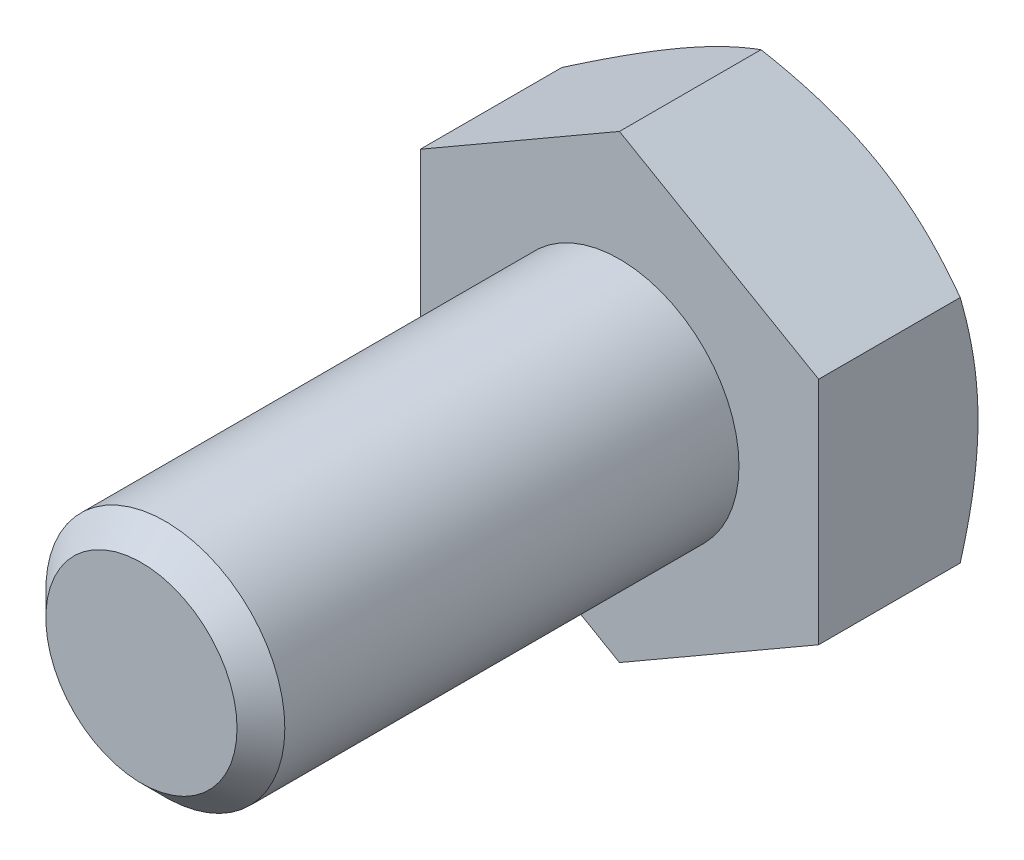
ISO-10303-21;
HEADER;
FILE_DESCRIPTION(('STEP AP214'),'2;1');
FILE_NAME('part.step','',(''),(''),'','','');
FILE_SCHEMA(('AUTOMOTIVE_DESIGN { 1 0 10303 214 1 1 1 1 }'));
ENDSEC;
DATA;
#1=APPLICATION_CONTEXT('core data for automotive mechanical design processes');
#2=APPLICATION_PROTOCOL_DEFINITION('international standard','automotive_design',2000,#1);
#3=PRODUCT_CONTEXT('',#1,'mechanical');
#4=PRODUCT('Part','Part','',(#3));
#5=PRODUCT_RELATED_PRODUCT_CATEGORY('part','',(#4));
#6=PRODUCT_DEFINITION_FORMATION('','',#4);
#7=PRODUCT_DEFINITION_CONTEXT('part definition',#1,'design');
#8=PRODUCT_DEFINITION('design','',#6,#7);
#9=PRODUCT_DEFINITION_SHAPE('','',#8);
#10=(LENGTH_UNIT() NAMED_UNIT(*) SI_UNIT(.MILLI.,.METRE.));
#11=(NAMED_UNIT(*) PLANE_ANGLE_UNIT() SI_UNIT($,.RADIAN.));
#12=(NAMED_UNIT(*) SI_UNIT($,.STERADIAN.) SOLID_ANGLE_UNIT());
#13=UNCERTAINTY_MEASURE_WITH_UNIT(LENGTH_MEASURE(1.E-05),#10,'distance_accuracy_value','');
#14=(GEOMETRIC_REPRESENTATION_CONTEXT(3) GLOBAL_UNCERTAINTY_ASSIGNED_CONTEXT((#13)) GLOBAL_UNIT_ASSIGNED_CONTEXT((#10,
#11,#12)) REPRESENTATION_CONTEXT('',''));
#15=CARTESIAN_POINT('',(0.,0.,0.));
#16=DIRECTION('',(0.,0.,1.));
#17=DIRECTION('',(1.,0.,0.));
#18=AXIS2_PLACEMENT_3D('',#15,#16,#17);
#19=CARTESIAN_POINT('',(0.,0.,12.));
#20=DIRECTION('',(0.,0.,1.));
#21=DIRECTION('',(1.,0.,0.));
#22=AXIS2_PLACEMENT_3D('',#19,#20,#21);
#23=PLANE('',#22);
#24=CARTESIAN_POINT('',(0.,0.,12.));
#25=DIRECTION('',(0.,0.,1.));
#26=DIRECTION('',(1.,0.,0.));
#27=AXIS2_PLACEMENT_3D('',#24,#25,#26);
#28=CIRCLE('',#27,2.4);
#29=CARTESIAN_POINT('',(2.4,0.,12.));
#30=VERTEX_POINT('',#29);
#31=EDGE_CURVE('E205',#30,#30,#28,.T.);
#32=ORIENTED_EDGE('',*,*,#31,.T.);
#33=EDGE_LOOP('',(#32));
#34=FACE_BOUND('',#33,.T.);
#35=ADVANCED_FACE('F31',(#34),#23,.T.);
#36=CARTESIAN_POINT('',(0.,0.,0.));
#37=DIRECTION('',(0.,0.,1.));
#38=DIRECTION('',(1.,0.,0.));
#39=AXIS2_PLACEMENT_3D('',#36,#37,#38);
#40=CYLINDRICAL_SURFACE('',#39,3.);
#41=CARTESIAN_POINT('',(0.,0.,11.4));
#42=DIRECTION('',(0.,0.,1.));
#43=DIRECTION('',(1.,0.,0.));
#44=AXIS2_PLACEMENT_3D('',#41,#42,#43);
#45=CIRCLE('',#44,3.);
#46=CARTESIAN_POINT('',(3.,0.,11.4));
#47=VERTEX_POINT('',#46);
#48=EDGE_CURVE('E207',#47,#47,#45,.F.);
#49=ORIENTED_EDGE('',*,*,#48,.T.);
#50=EDGE_LOOP('',(#49));
#51=FACE_BOUND('',#50,.T.);
#52=CARTESIAN_POINT('',(0.,0.,0.));
#53=DIRECTION('',(0.,0.,1.));
#54=DIRECTION('',(1.,0.,0.));
#55=AXIS2_PLACEMENT_3D('',#52,#53,#54);
#56=CIRCLE('',#55,3.);
#57=CARTESIAN_POINT('',(3.,0.,0.));
#58=VERTEX_POINT('',#57);
#59=EDGE_CURVE('E208',#58,#58,#56,.F.);
#60=ORIENTED_EDGE('',*,*,#59,.F.);
#61=EDGE_LOOP('',(#60));
#62=FACE_BOUND('',#61,.T.);
#63=ADVANCED_FACE('F196',(#51,#62),#40,.T.);
#64=CARTESIAN_POINT('',(0.,0.,12.));
#65=DIRECTION('',(0.,0.,-1.));
#66=DIRECTION('',(-1.,0.,0.));
#67=AXIS2_PLACEMENT_3D('',#64,#65,#66);
#68=CONICAL_SURFACE('',#67,2.4,0.785398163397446);
#69=ORIENTED_EDGE('',*,*,#48,.F.);
#70=EDGE_LOOP('',(#69));
#71=FACE_BOUND('',#70,.T.);
#72=ORIENTED_EDGE('',*,*,#31,.F.);
#73=EDGE_LOOP('',(#72));
#74=FACE_BOUND('',#73,.T.);
#75=ADVANCED_FACE('F201',(#71,#74),#68,.T.);
#76=CARTESIAN_POINT('',(0.,5.77350269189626,-4.));
#77=DIRECTION('',(0.499999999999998,0.86602540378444,0.));
#78=DIRECTION('',(-0.86602540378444,0.499999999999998,0.));
#79=AXIS2_PLACEMENT_3D('',#76,#77,#78);
#80=PLANE('',#79);
#81=CARTESIAN_POINT('',(-0.000200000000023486,5.7736181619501,-3.55335134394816));
#82=CARTESIAN_POINT('',(0.219534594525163,5.64675433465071,-3.62661343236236));
#83=CARTESIAN_POINT('',(0.441148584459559,5.5188054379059,-3.6932486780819));
#84=CARTESIAN_POINT('',(0.888213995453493,5.26069210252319,-3.80956100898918));
#85=CARTESIAN_POINT('',(1.11367335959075,5.13052307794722,-3.85919695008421));
#86=CARTESIAN_POINT('',(1.56183230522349,4.87177839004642,-3.9364489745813));
#87=CARTESIAN_POINT('',(1.78446209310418,4.74324302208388,-3.96457962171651));
#88=CARTESIAN_POINT('',(2.11918990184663,4.54998783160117,-3.98980507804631));
#89=CARTESIAN_POINT('',(2.23084219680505,4.48552534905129,-3.99538654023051));
#90=CARTESIAN_POINT('',(2.45424997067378,4.35654081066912,-4.00079778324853));
#91=CARTESIAN_POINT('',(2.5660054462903,4.29201875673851,-4.00062774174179));
#92=CARTESIAN_POINT('',(2.87218423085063,4.11524635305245,-3.99224636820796));
#93=CARTESIAN_POINT('',(3.0665060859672,4.00305457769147,-3.97817022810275));
#94=CARTESIAN_POINT('',(3.4538601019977,3.77941563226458,-3.93353474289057));
#95=CARTESIAN_POINT('',(3.64689090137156,3.66796924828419,-3.90296013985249));
#96=CARTESIAN_POINT('',(4.03502534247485,3.44387972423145,-3.82653150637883));
#97=CARTESIAN_POINT('',(4.23007999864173,3.33126486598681,-3.78035362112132));
#98=CARTESIAN_POINT('',(4.61728034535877,3.10771464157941,-3.67554820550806));
#99=CARTESIAN_POINT('',(4.80943099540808,2.99677641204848,-3.61694529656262));
#100=CARTESIAN_POINT('',(5.0002,2.8866358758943,-3.55335134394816));
#101=B_SPLINE_CURVE_WITH_KNOTS('',3,(#81,#82,#83,#84,#85,#86,#87,#88,#89,#90,#91,#92,#93,#94,
#95,#96,#97,#98,#99,#100),.UNSPECIFIED.,.F.,.F.,(4,2,2,2,2,2,2,2,2,4),(0.,0.792555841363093,
1.58701660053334,2.36181537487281,2.74884076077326,3.13585419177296,3.8096236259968,
4.48401723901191,5.1733688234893,5.86136694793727),.UNSPECIFIED.);
#102=CARTESIAN_POINT('',(0.,5.77350269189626,-3.55341801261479));
#103=VERTEX_POINT('',#102);
#104=CARTESIAN_POINT('',(2.49999999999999,4.3301270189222,-4.));
#105=VERTEX_POINT('',#104);
#106=EDGE_CURVE('E241',#103,#105,#101,.T.);
#107=ORIENTED_EDGE('',*,*,#106,.F.);
#108=DIRECTION('',(0.,0.,1.));
#109=VECTOR('',#108,1.);
#110=CARTESIAN_POINT('',(0.,5.77350269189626,-4.));
#111=LINE('',#110,#109);
#112=CARTESIAN_POINT('',(0.,5.77350269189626,0.));
#113=VERTEX_POINT('',#112);
#114=EDGE_CURVE('E215',#103,#113,#111,.T.);
#115=ORIENTED_EDGE('',*,*,#114,.T.);
#116=DIRECTION('',(-0.86602540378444,0.499999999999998,0.));
#117=VECTOR('',#116,1.);
#118=CARTESIAN_POINT('',(0.,5.77350269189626,0.));
#119=LINE('',#118,#117);
#120=CARTESIAN_POINT('',(5.,2.88675134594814,0.));
#121=VERTEX_POINT('',#120);
#122=EDGE_CURVE('E239',#121,#113,#119,.T.);
#123=ORIENTED_EDGE('',*,*,#122,.F.);
#124=DIRECTION('',(0.,0.,1.));
#125=VECTOR('',#124,1.);
#126=CARTESIAN_POINT('',(5.,2.88675134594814,-4.));
#127=LINE('',#126,#125);
#128=CARTESIAN_POINT('',(5.,2.88675134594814,-3.55341801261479));
#129=VERTEX_POINT('',#128);
#130=EDGE_CURVE('E212',#129,#121,#127,.T.);
#131=ORIENTED_EDGE('',*,*,#130,.F.);
#132=EDGE_CURVE('E171',#105,#129,#101,.T.);
#133=ORIENTED_EDGE('',*,*,#132,.F.);
#134=EDGE_LOOP('',(#107,#115,#123,#131,#133));
#135=FACE_BOUND('',#134,.T.);
#136=ADVANCED_FACE('F181',(#135),#80,.T.);
#137=CARTESIAN_POINT('',(5.,-2.88675134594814,-4.));
#138=DIRECTION('',(1.,0.,0.));
#139=DIRECTION('',(0.,0.,-1.));
#140=AXIS2_PLACEMENT_3D('',#137,#138,#139);
#141=PLANE('',#140);
#142=CARTESIAN_POINT('',(5.,-7.87365701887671,-1.5017575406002));
#143=CARTESIAN_POINT('',(5.,-7.65421637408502,-1.60868091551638));
#144=CARTESIAN_POINT('',(5.,-7.43428458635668,-1.71461296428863));
#145=CARTESIAN_POINT('',(5.,-6.99317792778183,-1.92393906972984));
#146=CARTESIAN_POINT('',(5.,-6.77200287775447,-2.0273327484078));
#147=CARTESIAN_POINT('',(5.,-6.32706593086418,-2.23152152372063));
#148=CARTESIAN_POINT('',(5.,-6.10329657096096,-2.3323004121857));
#149=CARTESIAN_POINT('',(5.,-5.65401907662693,-2.52988978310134));
#150=CARTESIAN_POINT('',(5.,-5.42851102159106,-2.62670044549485));
#151=CARTESIAN_POINT('',(5.,-4.96773019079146,-2.81850105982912));
#152=CARTESIAN_POINT('',(5.,-4.73238523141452,-2.91331851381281));
#153=CARTESIAN_POINT('',(5.,-4.2589865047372,-3.09606229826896));
#154=CARTESIAN_POINT('',(5.,-4.02093244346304,-3.18398787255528));
#155=CARTESIAN_POINT('',(5.,-3.54214478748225,-3.35072723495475));
#156=CARTESIAN_POINT('',(5.,-3.301417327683,-3.42955846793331));
#157=CARTESIAN_POINT('',(5.,-2.81651125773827,-3.57565910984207));
#158=CARTESIAN_POINT('',(5.,-2.57233372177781,-3.64293203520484));
#159=CARTESIAN_POINT('',(5.,-2.08173956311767,-3.7624103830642));
#160=CARTESIAN_POINT('',(5.,-1.83534384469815,-3.81470009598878));
#161=CARTESIAN_POINT('',(5.,-1.33936717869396,-3.90133365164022));
#162=CARTESIAN_POINT('',(5.,-1.08978658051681,-3.93567944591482));
#163=CARTESIAN_POINT('',(5.,-0.591994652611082,-3.98324171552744));
#164=CARTESIAN_POINT('',(5.,-0.343810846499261,-3.99673913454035));
#165=CARTESIAN_POINT('',(5.,0.152820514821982,-4.00220795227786));
#166=CARTESIAN_POINT('',(5.,0.401268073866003,-3.99417903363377));
#167=CARTESIAN_POINT('',(5.,0.819539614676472,-3.96311999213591));
#168=CARTESIAN_POINT('',(5.,0.989794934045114,-3.94552930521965));
#169=CARTESIAN_POINT('',(5.,1.32912938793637,-3.90127081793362));
#170=CARTESIAN_POINT('',(5.,1.49820837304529,-3.87460188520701));
#171=CARTESIAN_POINT('',(5.,2.00341173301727,-3.78237229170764));
#172=CARTESIAN_POINT('',(5.,2.33733597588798,-3.7046029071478));
#173=CARTESIAN_POINT('',(5.,2.83691487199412,-3.56883106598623));
#174=CARTESIAN_POINT('',(5.,3.00513229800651,-3.51971360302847));
#175=CARTESIAN_POINT('',(5.,3.33993504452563,-3.41615110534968));
#176=CARTESIAN_POINT('',(5.,3.50652035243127,-3.36170602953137));
#177=CARTESIAN_POINT('',(5.,3.83810926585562,-3.24838071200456));
#178=CARTESIAN_POINT('',(5.,4.00311330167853,-3.18950171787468));
#179=CARTESIAN_POINT('',(5.,4.33173746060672,-3.06802383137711));
#180=CARTESIAN_POINT('',(5.,4.49535761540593,-3.00542502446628));
#181=CARTESIAN_POINT('',(5.,4.93598294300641,-2.83201950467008));
#182=CARTESIAN_POINT('',(5.,5.21182602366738,-2.71826266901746));
#183=CARTESIAN_POINT('',(5.,5.76066658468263,-2.48405585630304));
#184=CARTESIAN_POINT('',(5.,6.03366374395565,-2.36360513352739));
#185=CARTESIAN_POINT('',(5.,6.57746623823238,-2.11759609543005));
#186=CARTESIAN_POINT('',(5.,6.84827068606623,-1.99203582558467));
#187=CARTESIAN_POINT('',(5.,7.38802449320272,-1.73703058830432));
#188=CARTESIAN_POINT('',(5.,7.65697392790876,-1.60758577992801));
#189=CARTESIAN_POINT('',(5.,8.19381940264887,-1.34544789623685));
#190=CARTESIAN_POINT('',(5.,8.46171304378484,-1.21274991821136));
#191=CARTESIAN_POINT('',(5.,8.99628800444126,-0.944933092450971));
#192=CARTESIAN_POINT('',(5.,9.26296931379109,-0.809814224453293));
#193=CARTESIAN_POINT('',(5.,10.0614145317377,-0.401627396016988));
#194=CARTESIAN_POINT('',(5.,10.5917004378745,-0.125669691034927));
#195=CARTESIAN_POINT('',(5.,11.5934978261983,0.401869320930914));
#196=CARTESIAN_POINT('',(5.,12.0652823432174,0.652934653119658));
#197=CARTESIAN_POINT('',(5.,13.0072652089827,1.15809174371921));
#198=CARTESIAN_POINT('',(5.,13.4774634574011,1.41218368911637));
#199=CARTESIAN_POINT('',(5.,14.4150598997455,1.92174727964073));
#200=CARTESIAN_POINT('',(5.,14.8824621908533,2.17721139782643));
#201=CARTESIAN_POINT('',(5.,15.8162766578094,2.68985606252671));
#202=CARTESIAN_POINT('',(5.,16.2826889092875,2.94703647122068));
#203=CARTESIAN_POINT('',(5.,16.7487534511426,3.20484156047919));
#204=B_SPLINE_CURVE_WITH_KNOTS('',3,(#142,#143,#144,#145,#146,#147,#148,#149,#150,#151,#152,
#153,#154,#155,#156,#157,#158,#159,#160,#161,#162,#163,#164,#165,#166,#167,#168,#169,#170,#171,
#172,#173,#174,#175,#176,#177,#178,#179,#180,#181,#182,#183,#184,#185,#186,#187,#188,#189,#190,
#191,#192,#193,#194,#195,#196,#197,#198,#199,#200,#201,#202,#203),.UNSPECIFIED.,.F.,.F.,(4,2,2,
2,2,2,2,2,2,2,2,2,2,2,2,2,2,2,2,2,2,2,2,2,2,2,2,2,2,2,4),(0.,0.732320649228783,1.46474969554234,
2.20096737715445,2.93715163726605,3.69825037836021,4.45943251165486,5.2191293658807,
5.97859468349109,6.73369963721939,7.48872245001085,8.2334792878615,8.97824710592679,
9.49148539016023,10.0047877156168,11.0318914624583,11.5575684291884,12.0832494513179,
12.6087831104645,13.1343047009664,14.0293094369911,14.9244140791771,15.819864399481,
16.7152781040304,17.612136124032,18.5090016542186,20.3023290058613,21.9056050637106,
23.5089806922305,25.106957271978,26.7048070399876),.UNSPECIFIED.);
#205=CARTESIAN_POINT('',(5.,0.,-4.));
#206=VERTEX_POINT('',#205);
#207=EDGE_CURVE('E169',#129,#206,#204,.F.);
#208=ORIENTED_EDGE('',*,*,#207,.F.);
#209=ORIENTED_EDGE('',*,*,#130,.T.);
#210=DIRECTION('',(0.,1.,0.));
#211=VECTOR('',#210,1.);
#212=CARTESIAN_POINT('',(5.,-2.88675134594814,0.));
#213=LINE('',#212,#211);
#214=CARTESIAN_POINT('',(5.,-2.88675134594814,0.));
#215=VERTEX_POINT('',#214);
#216=EDGE_CURVE('E217',#215,#121,#213,.T.);
#217=ORIENTED_EDGE('',*,*,#216,.F.);
#218=DIRECTION('',(0.,0.,1.));
#219=VECTOR('',#218,1.);
#220=CARTESIAN_POINT('',(5.,-2.88675134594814,-4.));
#221=LINE('',#220,#219);
#222=CARTESIAN_POINT('',(5.,-2.88675134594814,-3.55341801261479));
#223=VERTEX_POINT('',#222);
#224=EDGE_CURVE('E223',#223,#215,#221,.T.);
#225=ORIENTED_EDGE('',*,*,#224,.F.);
#226=EDGE_CURVE('E164',#206,#223,#204,.F.);
#227=ORIENTED_EDGE('',*,*,#226,.F.);
#228=EDGE_LOOP('',(#208,#209,#217,#225,#227));
#229=FACE_BOUND('',#228,.T.);
#230=ADVANCED_FACE('F177',(#229),#141,.T.);
#231=CARTESIAN_POINT('',(0.,-5.77350269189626,-4.));
#232=DIRECTION('',(0.499999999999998,-0.86602540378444,0.));
#233=DIRECTION('',(0.86602540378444,0.499999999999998,0.));
#234=AXIS2_PLACEMENT_3D('',#231,#232,#233);
#235=PLANE('',#234);
#236=CARTESIAN_POINT('',(5.0002,-2.8866358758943,-3.55335134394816));
#237=CARTESIAN_POINT('',(4.78046540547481,-3.01349970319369,-3.62661343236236));
#238=CARTESIAN_POINT('',(4.55885141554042,-3.1414485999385,-3.6932486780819));
#239=CARTESIAN_POINT('',(4.11178600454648,-3.39956193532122,-3.80956100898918));
#240=CARTESIAN_POINT('',(3.88632664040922,-3.52973095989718,-3.85919695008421));
#241=CARTESIAN_POINT('',(3.43816769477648,-3.78847564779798,-3.9364489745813));
#242=CARTESIAN_POINT('',(3.2155379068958,-3.91701101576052,-3.96457962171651));
#243=CARTESIAN_POINT('',(2.88081009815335,-4.11026620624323,-3.98980507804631));
#244=CARTESIAN_POINT('',(2.76915780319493,-4.17472868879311,-3.99538654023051));
#245=CARTESIAN_POINT('',(2.54575002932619,-4.30371322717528,-4.00079778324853));
#246=CARTESIAN_POINT('',(2.43399455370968,-4.36823528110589,-4.00062774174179));
#247=CARTESIAN_POINT('',(2.12781576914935,-4.54500768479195,-3.99224636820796));
#248=CARTESIAN_POINT('',(1.93349391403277,-4.65719946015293,-3.97817022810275));
#249=CARTESIAN_POINT('',(1.54613989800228,-4.88083840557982,-3.93353474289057));
#250=CARTESIAN_POINT('',(1.35310909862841,-4.99228478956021,-3.90296013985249));
#251=CARTESIAN_POINT('',(0.964974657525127,-5.21637431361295,-3.82653150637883));
#252=CARTESIAN_POINT('',(0.769920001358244,-5.32898917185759,-3.78035362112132));
#253=CARTESIAN_POINT('',(0.382719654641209,-5.55253939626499,-3.67554820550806));
#254=CARTESIAN_POINT('',(0.19056900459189,-5.66347762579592,-3.61694529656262));
#255=CARTESIAN_POINT('',(-0.000200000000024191,-5.7736181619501,-3.55335134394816));
#256=B_SPLINE_CURVE_WITH_KNOTS('',3,(#236,#237,#238,#239,#240,#241,#242,#243,#244,#245,#246,
#247,#248,#249,#250,#251,#252,#253,#254,#255),.UNSPECIFIED.,.F.,.F.,(4,2,2,2,2,2,2,2,2,4),(0.,
0.792555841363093,1.58701660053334,2.36181537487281,2.74884076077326,3.13585419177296,
3.8096236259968,4.48401723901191,5.1733688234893,5.86136694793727),.UNSPECIFIED.);
#257=CARTESIAN_POINT('',(2.49999999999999,-4.3301270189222,-4.));
#258=VERTEX_POINT('',#257);
#259=EDGE_CURVE('E170',#223,#258,#256,.T.);
#260=ORIENTED_EDGE('',*,*,#259,.F.);
#261=ORIENTED_EDGE('',*,*,#224,.T.);
#262=DIRECTION('',(0.86602540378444,0.499999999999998,0.));
#263=VECTOR('',#262,1.);
#264=CARTESIAN_POINT('',(0.,-5.77350269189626,0.));
#265=LINE('',#264,#263);
#266=CARTESIAN_POINT('',(0.,-5.77350269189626,0.));
#267=VERTEX_POINT('',#266);
#268=EDGE_CURVE('E228',#267,#215,#265,.T.);
#269=ORIENTED_EDGE('',*,*,#268,.F.);
#270=DIRECTION('',(0.,0.,1.));
#271=VECTOR('',#270,1.);
#272=CARTESIAN_POINT('',(0.,-5.77350269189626,-4.));
#273=LINE('',#272,#271);
#274=CARTESIAN_POINT('',(0.,-5.77350269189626,-3.55341801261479));
#275=VERTEX_POINT('',#274);
#276=EDGE_CURVE('E221',#275,#267,#273,.T.);
#277=ORIENTED_EDGE('',*,*,#276,.F.);
#278=EDGE_CURVE('E158',#258,#275,#256,.T.);
#279=ORIENTED_EDGE('',*,*,#278,.F.);
#280=EDGE_LOOP('',(#260,#261,#269,#277,#279));
#281=FACE_BOUND('',#280,.T.);
#282=ADVANCED_FACE('F180',(#281),#235,.T.);
#283=CARTESIAN_POINT('',(0.,-5.77350269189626,-4.));
#284=DIRECTION('',(-0.500000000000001,-0.866025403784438,0.));
#285=DIRECTION('',(0.866025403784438,-0.500000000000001,0.));
#286=AXIS2_PLACEMENT_3D('',#283,#284,#285);
#287=PLANE('',#286);
#288=CARTESIAN_POINT('',(0.000199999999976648,-5.7736181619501,-3.55335134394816));
#289=CARTESIAN_POINT('',(-0.219534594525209,-5.64675433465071,-3.62661343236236));
#290=CARTESIAN_POINT('',(-0.441148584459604,-5.5188054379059,-3.6932486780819));
#291=CARTESIAN_POINT('',(-0.888213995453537,-5.26069210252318,-3.80956100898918));
#292=CARTESIAN_POINT('',(-1.1136733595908,-5.13052307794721,-3.8591969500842));
#293=CARTESIAN_POINT('',(-1.56183230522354,-4.87177839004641,-3.9364489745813));
#294=CARTESIAN_POINT('',(-1.78446209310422,-4.74324302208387,-3.9645796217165));
#295=CARTESIAN_POINT('',(-2.11918990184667,-4.54998783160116,-3.98980507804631));
#296=CARTESIAN_POINT('',(-2.23084219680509,-4.48552534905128,-3.99538654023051));
#297=CARTESIAN_POINT('',(-2.45424997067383,-4.35654081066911,-4.00079778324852));
#298=CARTESIAN_POINT('',(-2.56600544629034,-4.2920187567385,-4.00062774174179));
#299=CARTESIAN_POINT('',(-2.87218423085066,-4.11524635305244,-3.99224636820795));
#300=CARTESIAN_POINT('',(-3.06650608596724,-4.00305457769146,-3.97817022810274));
#301=CARTESIAN_POINT('',(-3.45386010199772,-3.77941563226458,-3.93353474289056));
#302=CARTESIAN_POINT('',(-3.64689090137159,-3.66796924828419,-3.90296013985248));
#303=CARTESIAN_POINT('',(-4.03502534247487,-3.44387972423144,-3.82653150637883));
#304=CARTESIAN_POINT('',(-4.23007999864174,-3.33126486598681,-3.78035362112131));
#305=CARTESIAN_POINT('',(-4.61728034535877,-3.10771464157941,-3.67554820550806));
#306=CARTESIAN_POINT('',(-4.80943099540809,-2.99677641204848,-3.61694529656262));
#307=CARTESIAN_POINT('',(-5.0002,-2.8866358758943,-3.55335134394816));
#308=B_SPLINE_CURVE_WITH_KNOTS('',3,(#288,#289,#290,#291,#292,#293,#294,#295,#296,#297,#298,
#299,#300,#301,#302,#303,#304,#305,#306,#307),.UNSPECIFIED.,.F.,.F.,(4,2,2,2,2,2,2,2,2,4),(0.,
0.792555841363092,1.58701660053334,2.36181537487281,2.74884076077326,3.13585419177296,
3.80962362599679,4.48401723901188,5.17336882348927,5.86136694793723),.UNSPECIFIED.);
#309=CARTESIAN_POINT('',(-2.50000000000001,-4.33012701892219,-4.));
#310=VERTEX_POINT('',#309);
#311=EDGE_CURVE('E260',#275,#310,#308,.T.);
#312=ORIENTED_EDGE('',*,*,#311,.F.);
#313=ORIENTED_EDGE('',*,*,#276,.T.);
#314=DIRECTION('',(0.866025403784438,-0.500000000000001,0.));
#315=VECTOR('',#314,1.);
#316=CARTESIAN_POINT('',(0.,-5.77350269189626,0.));
#317=LINE('',#316,#315);
#318=CARTESIAN_POINT('',(-5.,-2.88675134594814,0.));
#319=VERTEX_POINT('',#318);
#320=EDGE_CURVE('E231',#319,#267,#317,.T.);
#321=ORIENTED_EDGE('',*,*,#320,.F.);
#322=DIRECTION('',(0.,0.,1.));
#323=VECTOR('',#322,1.);
#324=CARTESIAN_POINT('',(-5.,-2.88675134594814,-4.));
#325=LINE('',#324,#323);
#326=CARTESIAN_POINT('',(-5.,-2.88675134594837,-3.55341801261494));
#327=VERTEX_POINT('',#326);
#328=EDGE_CURVE('E219',#327,#319,#325,.T.);
#329=ORIENTED_EDGE('',*,*,#328,.F.);
#330=EDGE_CURVE('E107',#310,#327,#308,.T.);
#331=ORIENTED_EDGE('',*,*,#330,.F.);
#332=EDGE_LOOP('',(#312,#313,#321,#329,#331));
#333=FACE_BOUND('',#332,.T.);
#334=ADVANCED_FACE('F185',(#333),#287,.T.);
#335=CARTESIAN_POINT('',(-5.,-2.88675134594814,-4.));
#336=DIRECTION('',(-1.,0.,0.));
#337=DIRECTION('',(0.,0.,1.));
#338=AXIS2_PLACEMENT_3D('',#335,#336,#337);
#339=PLANE('',#338);
#340=CARTESIAN_POINT('',(-5.,-7.87365701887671,-1.5017575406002));
#341=CARTESIAN_POINT('',(-5.,-7.65421637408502,-1.60868091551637));
#342=CARTESIAN_POINT('',(-5.,-7.43428458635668,-1.71461296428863));
#343=CARTESIAN_POINT('',(-5.,-6.99317792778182,-1.92393906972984));
#344=CARTESIAN_POINT('',(-5.,-6.77200287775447,-2.02733274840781));
#345=CARTESIAN_POINT('',(-5.,-6.32706593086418,-2.23152152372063));
#346=CARTESIAN_POINT('',(-5.,-6.10329657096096,-2.3323004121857));
#347=CARTESIAN_POINT('',(-5.,-5.65401907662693,-2.52988978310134));
#348=CARTESIAN_POINT('',(-5.,-5.42851102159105,-2.62670044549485));
#349=CARTESIAN_POINT('',(-5.,-4.96773019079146,-2.81850105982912));
#350=CARTESIAN_POINT('',(-5.,-4.73238523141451,-2.91331851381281));
#351=CARTESIAN_POINT('',(-5.,-4.2589865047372,-3.09606229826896));
#352=CARTESIAN_POINT('',(-5.,-4.02093244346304,-3.18398787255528));
#353=CARTESIAN_POINT('',(-5.,-3.54214478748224,-3.35072723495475));
#354=CARTESIAN_POINT('',(-5.,-3.301417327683,-3.42955846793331));
#355=CARTESIAN_POINT('',(-5.,-2.81651125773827,-3.57565910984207));
#356=CARTESIAN_POINT('',(-5.,-2.57233372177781,-3.64293203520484));
#357=CARTESIAN_POINT('',(-5.,-2.08173956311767,-3.7624103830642));
#358=CARTESIAN_POINT('',(-5.,-1.83534384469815,-3.81470009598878));
#359=CARTESIAN_POINT('',(-5.,-1.33936717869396,-3.90133365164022));
#360=CARTESIAN_POINT('',(-5.,-1.08978658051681,-3.93567944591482));
#361=CARTESIAN_POINT('',(-5.,-0.591994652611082,-3.98324171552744));
#362=CARTESIAN_POINT('',(-5.,-0.343810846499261,-3.99673913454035));
#363=CARTESIAN_POINT('',(-5.,0.152820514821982,-4.00220795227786));
#364=CARTESIAN_POINT('',(-5.,0.401268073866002,-3.99417903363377));
#365=CARTESIAN_POINT('',(-5.,0.819539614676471,-3.96311999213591));
#366=CARTESIAN_POINT('',(-5.,0.989794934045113,-3.94552930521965));
#367=CARTESIAN_POINT('',(-5.,1.32912938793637,-3.90127081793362));
#368=CARTESIAN_POINT('',(-5.,1.49820837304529,-3.87460188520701));
#369=CARTESIAN_POINT('',(-5.,2.00341173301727,-3.78237229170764));
#370=CARTESIAN_POINT('',(-5.,2.33733597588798,-3.7046029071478));
#371=CARTESIAN_POINT('',(-5.,2.83691487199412,-3.56883106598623));
#372=CARTESIAN_POINT('',(-5.,3.00513229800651,-3.51971360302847));
#373=CARTESIAN_POINT('',(-5.,3.33993504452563,-3.41615110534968));
#374=CARTESIAN_POINT('',(-5.,3.50652035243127,-3.36170602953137));
#375=CARTESIAN_POINT('',(-5.,3.83810926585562,-3.24838071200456));
#376=CARTESIAN_POINT('',(-5.,4.00311330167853,-3.18950171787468));
#377=CARTESIAN_POINT('',(-5.,4.33173746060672,-3.06802383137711));
#378=CARTESIAN_POINT('',(-5.,4.49535761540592,-3.00542502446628));
#379=CARTESIAN_POINT('',(-5.,4.9359829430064,-2.83201950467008));
#380=CARTESIAN_POINT('',(-5.,5.21182602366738,-2.71826266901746));
#381=CARTESIAN_POINT('',(-5.,5.76066658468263,-2.48405585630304));
#382=CARTESIAN_POINT('',(-5.,6.03366374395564,-2.36360513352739));
#383=CARTESIAN_POINT('',(-5.,6.57746623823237,-2.11759609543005));
#384=CARTESIAN_POINT('',(-5.,6.84827068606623,-1.99203582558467));
#385=CARTESIAN_POINT('',(-5.,7.38802449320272,-1.73703058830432));
#386=CARTESIAN_POINT('',(-5.,7.65697392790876,-1.60758577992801));
#387=CARTESIAN_POINT('',(-5.,8.19381940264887,-1.34544789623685));
#388=CARTESIAN_POINT('',(-5.,8.46171304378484,-1.21274991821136));
#389=CARTESIAN_POINT('',(-5.,8.99628800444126,-0.94493309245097));
#390=CARTESIAN_POINT('',(-5.,9.26296931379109,-0.809814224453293));
#391=CARTESIAN_POINT('',(-5.,10.0614145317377,-0.401627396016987));
#392=CARTESIAN_POINT('',(-5.,10.5917004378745,-0.125669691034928));
#393=CARTESIAN_POINT('',(-5.,11.5934978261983,0.401869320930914));
#394=CARTESIAN_POINT('',(-5.,12.0652823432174,0.652934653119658));
#395=CARTESIAN_POINT('',(-5.,13.0072652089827,1.15809174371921));
#396=CARTESIAN_POINT('',(-5.,13.4774634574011,1.41218368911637));
#397=CARTESIAN_POINT('',(-5.,14.4150598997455,1.92174727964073));
#398=CARTESIAN_POINT('',(-5.,14.8824621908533,2.17721139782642));
#399=CARTESIAN_POINT('',(-5.,15.8162766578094,2.68985606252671));
#400=CARTESIAN_POINT('',(-5.,16.2826889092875,2.94703647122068));
#401=CARTESIAN_POINT('',(-5.,16.7487534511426,3.20484156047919));
#402=B_SPLINE_CURVE_WITH_KNOTS('',3,(#340,#341,#342,#343,#344,#345,#346,#347,#348,#349,#350,
#351,#352,#353,#354,#355,#356,#357,#358,#359,#360,#361,#362,#363,#364,#365,#366,#367,#368,#369,
#370,#371,#372,#373,#374,#375,#376,#377,#378,#379,#380,#381,#382,#383,#384,#385,#386,#387,#388,
#389,#390,#391,#392,#393,#394,#395,#396,#397,#398,#399,#400,#401),.UNSPECIFIED.,.F.,.F.,(4,2,2,
2,2,2,2,2,2,2,2,2,2,2,2,2,2,2,2,2,2,2,2,2,2,2,2,2,2,2,4),(0.,0.732320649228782,1.46474969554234,
2.20096737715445,2.93715163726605,3.69825037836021,4.45943251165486,5.2191293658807,
5.97859468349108,6.73369963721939,7.48872245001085,8.2334792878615,8.97824710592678,
9.49148539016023,10.0047877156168,11.0318914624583,11.5575684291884,12.0832494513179,
12.6087831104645,13.1343047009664,14.0293094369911,14.9244140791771,15.819864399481,
16.7152781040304,17.612136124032,18.5090016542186,20.3023290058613,21.9056050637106,
23.5089806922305,25.106957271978,26.7048070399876),.UNSPECIFIED.);
#403=CARTESIAN_POINT('',(-5.,0.,-4.));
#404=VERTEX_POINT('',#403);
#405=EDGE_CURVE('E102',#327,#404,#402,.T.);
#406=ORIENTED_EDGE('',*,*,#405,.F.);
#407=ORIENTED_EDGE('',*,*,#328,.T.);
#408=DIRECTION('',(0.,-1.,0.));
#409=VECTOR('',#408,1.);
#410=CARTESIAN_POINT('',(-5.,-2.88675134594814,0.));
#411=LINE('',#410,#409);
#412=CARTESIAN_POINT('',(-5.,2.88675134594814,0.));
#413=VERTEX_POINT('',#412);
#414=EDGE_CURVE('E234',#413,#319,#411,.T.);
#415=ORIENTED_EDGE('',*,*,#414,.F.);
#416=DIRECTION('',(0.,0.,1.));
#417=VECTOR('',#416,1.);
#418=CARTESIAN_POINT('',(-5.,2.88675134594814,-4.));
#419=LINE('',#418,#417);
#420=CARTESIAN_POINT('',(-5.,2.88675134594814,-3.55341801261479));
#421=VERTEX_POINT('',#420);
#422=EDGE_CURVE('E128',#421,#413,#419,.T.);
#423=ORIENTED_EDGE('',*,*,#422,.F.);
#424=EDGE_CURVE('E111',#404,#421,#402,.T.);
#425=ORIENTED_EDGE('',*,*,#424,.F.);
#426=EDGE_LOOP('',(#406,#407,#415,#423,#425));
#427=FACE_BOUND('',#426,.T.);
#428=ADVANCED_FACE('F126',(#427),#339,.T.);
#429=CARTESIAN_POINT('',(-5.,2.88675134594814,-4.));
#430=DIRECTION('',(-0.500000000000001,0.866025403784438,0.));
#431=DIRECTION('',(-0.866025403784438,-0.500000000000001,0.));
#432=AXIS2_PLACEMENT_3D('',#429,#430,#431);
#433=PLANE('',#432);
#434=CARTESIAN_POINT('',(-5.0002,2.8866358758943,-3.55335134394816));
#435=CARTESIAN_POINT('',(-4.78046540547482,3.01349970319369,-3.62661343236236));
#436=CARTESIAN_POINT('',(-4.55885141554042,3.1414485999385,-3.6932486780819));
#437=CARTESIAN_POINT('',(-4.11178600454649,3.39956193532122,-3.80956100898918));
#438=CARTESIAN_POINT('',(-3.88632664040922,3.52973095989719,-3.8591969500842));
#439=CARTESIAN_POINT('',(-3.43816769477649,3.78847564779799,-3.9364489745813));
#440=CARTESIAN_POINT('',(-3.2155379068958,3.91701101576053,-3.9645796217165));
#441=CARTESIAN_POINT('',(-2.88081009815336,4.11026620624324,-3.98980507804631));
#442=CARTESIAN_POINT('',(-2.76915780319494,4.17472868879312,-3.99538654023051));
#443=CARTESIAN_POINT('',(-2.5457500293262,4.30371322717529,-4.00079778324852));
#444=CARTESIAN_POINT('',(-2.43399455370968,4.3682352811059,-4.00062774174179));
#445=CARTESIAN_POINT('',(-2.12781576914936,4.54500768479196,-3.99224636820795));
#446=CARTESIAN_POINT('',(-1.93349391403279,4.65719946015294,-3.97817022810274));
#447=CARTESIAN_POINT('',(-1.5461398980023,4.88083840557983,-3.93353474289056));
#448=CARTESIAN_POINT('',(-1.35310909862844,4.99228478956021,-3.90296013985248));
#449=CARTESIAN_POINT('',(-0.964974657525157,5.21637431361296,-3.82653150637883));
#450=CARTESIAN_POINT('',(-0.769920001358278,5.32898917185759,-3.78035362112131));
#451=CARTESIAN_POINT('',(-0.38271965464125,5.55253939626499,-3.67554820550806));
#452=CARTESIAN_POINT('',(-0.190569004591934,5.66347762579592,-3.61694529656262));
#453=CARTESIAN_POINT('',(0.000199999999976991,5.7736181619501,-3.55335134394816));
#454=B_SPLINE_CURVE_WITH_KNOTS('',3,(#434,#435,#436,#437,#438,#439,#440,#441,#442,#443,#444,
#445,#446,#447,#448,#449,#450,#451,#452,#453),.UNSPECIFIED.,.F.,.F.,(4,2,2,2,2,2,2,2,2,4),(0.,
0.792555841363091,1.58701660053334,2.36181537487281,2.74884076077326,3.13585419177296,
3.80962362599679,4.48401723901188,5.17336882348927,5.86136694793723),.UNSPECIFIED.);
#455=CARTESIAN_POINT('',(-2.50000000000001,4.3301270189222,-4.));
#456=VERTEX_POINT('',#455);
#457=EDGE_CURVE('E117',#421,#456,#454,.T.);
#458=ORIENTED_EDGE('',*,*,#457,.F.);
#459=ORIENTED_EDGE('',*,*,#422,.T.);
#460=DIRECTION('',(-0.866025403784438,-0.500000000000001,0.));
#461=VECTOR('',#460,1.);
#462=CARTESIAN_POINT('',(-5.,2.88675134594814,0.));
#463=LINE('',#462,#461);
#464=EDGE_CURVE('E237',#113,#413,#463,.T.);
#465=ORIENTED_EDGE('',*,*,#464,.F.);
#466=ORIENTED_EDGE('',*,*,#114,.F.);
#467=EDGE_CURVE('E119',#456,#103,#454,.T.);
#468=ORIENTED_EDGE('',*,*,#467,.F.);
#469=EDGE_LOOP('',(#458,#459,#465,#466,#468));
#470=FACE_BOUND('',#469,.T.);
#471=ADVANCED_FACE('F193',(#470),#433,.T.);
#472=CARTESIAN_POINT('',(5.,2.88675134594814,0.));
#473=DIRECTION('',(0.,0.,1.));
#474=DIRECTION('',(1.,0.,0.));
#475=AXIS2_PLACEMENT_3D('',#472,#473,#474);
#476=PLANE('',#475);
#477=ORIENTED_EDGE('',*,*,#59,.T.);
#478=EDGE_LOOP('',(#477));
#479=FACE_BOUND('',#478,.T.);
#480=ORIENTED_EDGE('',*,*,#122,.T.);
#481=ORIENTED_EDGE('',*,*,#464,.T.);
#482=ORIENTED_EDGE('',*,*,#414,.T.);
#483=ORIENTED_EDGE('',*,*,#320,.T.);
#484=ORIENTED_EDGE('',*,*,#268,.T.);
#485=ORIENTED_EDGE('',*,*,#216,.T.);
#486=EDGE_LOOP('',(#480,#481,#482,#483,#484,#485));
#487=FACE_BOUND('',#486,.T.);
#488=ADVANCED_FACE('F150',(#479,#487),#476,.T.);
#489=CARTESIAN_POINT('',(0.,0.,0.));
#490=DIRECTION('',(0.,0.,1.));
#491=DIRECTION('',(1.,0.,0.));
#492=AXIS2_PLACEMENT_3D('',#489,#490,#491);
#493=CONICAL_SURFACE('',#492,11.9282032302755,1.0471975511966);
#494=ORIENTED_EDGE('',*,*,#132,.T.);
#495=ORIENTED_EDGE('',*,*,#207,.T.);
#496=CARTESIAN_POINT('',(0.,0.,-4.));
#497=DIRECTION('',(0.,0.,1.));
#498=DIRECTION('',(1.,0.,0.));
#499=AXIS2_PLACEMENT_3D('',#496,#497,#498);
#500=CIRCLE('',#499,5.);
#501=EDGE_CURVE('E34',#105,#206,#500,.F.);
#502=ORIENTED_EDGE('',*,*,#501,.F.);
#503=EDGE_LOOP('',(#494,#495,#502));
#504=FACE_BOUND('',#503,.T.);
#505=ADVANCED_FACE('F250',(#504),#493,.T.);
#506=ORIENTED_EDGE('',*,*,#106,.T.);
#507=EDGE_CURVE('E124',#456,#105,#500,.F.);
#508=ORIENTED_EDGE('',*,*,#507,.F.);
#509=ORIENTED_EDGE('',*,*,#467,.T.);
#510=EDGE_LOOP('',(#506,#508,#509));
#511=FACE_BOUND('',#510,.T.);
#512=ADVANCED_FACE('F149',(#511),#493,.T.);
#513=ORIENTED_EDGE('',*,*,#424,.T.);
#514=ORIENTED_EDGE('',*,*,#457,.T.);
#515=CARTESIAN_POINT('',(0.,0.,-4.));
#516=DIRECTION('',(0.,0.,-1.));
#517=DIRECTION('',(-1.,0.,0.));
#518=AXIS2_PLACEMENT_3D('',#515,#516,#517);
#519=CIRCLE('',#518,5.);
#520=EDGE_CURVE('E52',#404,#456,#519,.T.);
#521=ORIENTED_EDGE('',*,*,#520,.F.);
#522=EDGE_LOOP('',(#513,#514,#521));
#523=FACE_BOUND('',#522,.T.);
#524=ADVANCED_FACE('F115',(#523),#493,.T.);
#525=ORIENTED_EDGE('',*,*,#330,.T.);
#526=ORIENTED_EDGE('',*,*,#405,.T.);
#527=EDGE_CURVE('E104',#310,#404,#500,.F.);
#528=ORIENTED_EDGE('',*,*,#527,.F.);
#529=EDGE_LOOP('',(#525,#526,#528));
#530=FACE_BOUND('',#529,.T.);
#531=ADVANCED_FACE('F103',(#530),#493,.T.);
#532=ORIENTED_EDGE('',*,*,#278,.T.);
#533=ORIENTED_EDGE('',*,*,#311,.T.);
#534=EDGE_CURVE('E39',#258,#310,#500,.F.);
#535=ORIENTED_EDGE('',*,*,#534,.F.);
#536=EDGE_LOOP('',(#532,#533,#535));
#537=FACE_BOUND('',#536,.T.);
#538=ADVANCED_FACE('F262',(#537),#493,.T.);
#539=ORIENTED_EDGE('',*,*,#226,.T.);
#540=ORIENTED_EDGE('',*,*,#259,.T.);
#541=EDGE_CURVE('E11',#206,#258,#500,.F.);
#542=ORIENTED_EDGE('',*,*,#541,.F.);
#543=EDGE_LOOP('',(#539,#540,#542));
#544=FACE_BOUND('',#543,.T.);
#545=ADVANCED_FACE('F257',(#544),#493,.T.);
#546=CARTESIAN_POINT('',(5.,2.88675134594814,-4.));
#547=DIRECTION('',(0.,0.,1.));
#548=DIRECTION('',(1.,0.,0.));
#549=AXIS2_PLACEMENT_3D('',#546,#547,#548);
#550=PLANE('',#549);
#551=ORIENTED_EDGE('',*,*,#501,.T.);
#552=ORIENTED_EDGE('',*,*,#541,.T.);
#553=ORIENTED_EDGE('',*,*,#534,.T.);
#554=ORIENTED_EDGE('',*,*,#527,.T.);
#555=ORIENTED_EDGE('',*,*,#520,.T.);
#556=ORIENTED_EDGE('',*,*,#507,.T.);
#557=EDGE_LOOP('',(#551,#552,#553,#554,#555,#556));
#558=FACE_BOUND('',#557,.T.);
#559=ADVANCED_FACE('F122',(#558),#550,.F.);
#560=CLOSED_SHELL('',(#35,#63,#75,#136,#230,#282,#334,#428,#471,#488,#505,#512,#524,#531,#538,
#545,#559));
#561=MANIFOLD_SOLID_BREP('B2',#560);
#562=ADVANCED_BREP_SHAPE_REPRESENTATION('',(#18,#561),#14);
#563=SHAPE_DEFINITION_REPRESENTATION(#9,#562);
ENDSEC;
END-ISO-10303-21;
